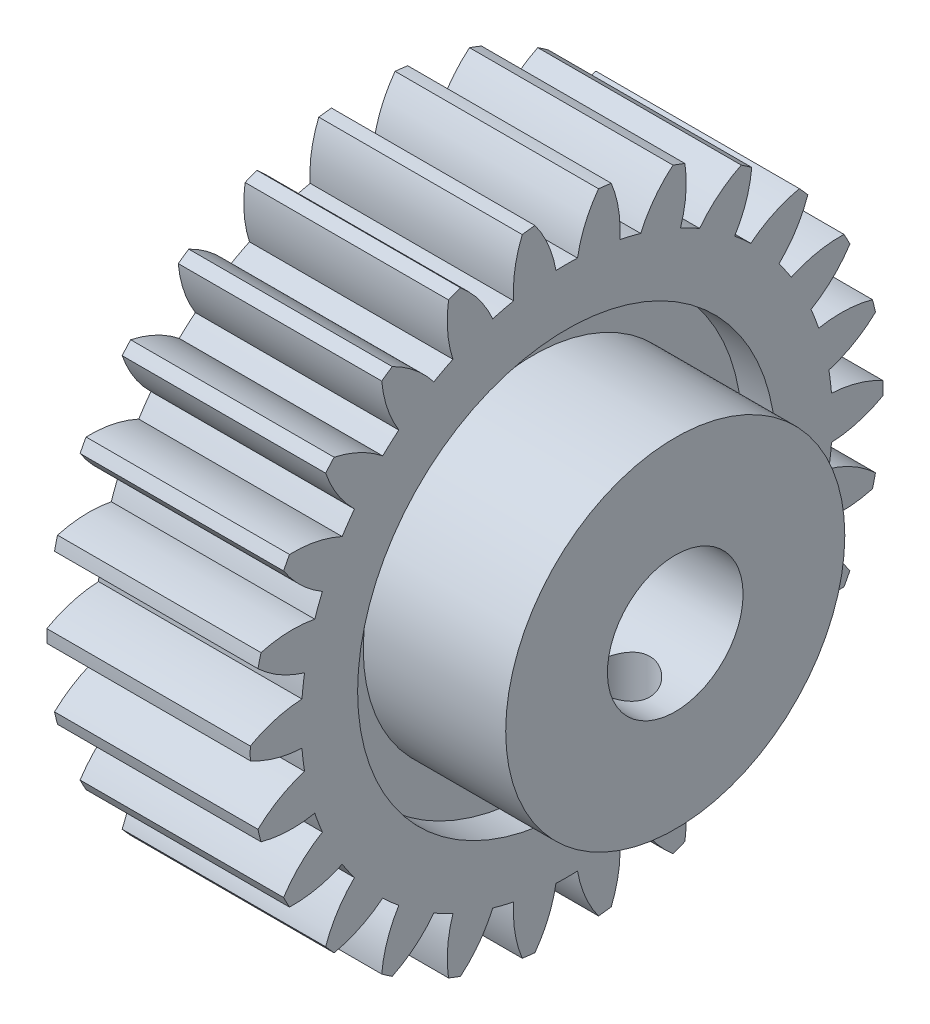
from build123d import *

# Parameters (mm, degrees)
BASPROSKE_W             = 9
BASPROSKE_H             = 14
TOOTHCUT_DEPTH          = 22.748563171
TEETHCUTS_COUNT         = 26
TEETHCUTS_ANGLE         = 346.153846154
HUBNEAONESKE_R          = 7.5
HUBNEARONE_DEPTH        = 9.0000508
BORSKE_R                = 3
BORE_DEPTH              = 18.0000508
CUT_EXTRUDE1_DEPTH      = 22.703049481
CUT_EXTRUDE1_DEPTH_BACK = 22.703049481
SKETCH1_W               = 6.3000508
SKETCH1_H               = 15.02384493
SKETCH2_R               = 9.25
SKETCH2_R_2             = 7.5
CUT_EXTRUDE2_DEPTH      = 1.5
CUT_EXTRUDE3_START      = -7.5
SKETCH2_2_R             = 9.25
SKETCH2_2_R_2           = 7.5
CUT_EXTRUDE3_DEPTH      = 1.5
BOSS_EXTRUDE1_START     = 4.8
SKETCH3_R               = 7.5
SKETCH3_R_2             = 3
BOSS_EXTRUDE1_DEPTH     = 4.8
CUT_EXTRUDE4_REACH      = 26.093
CUT_EXTRUDE4_END_RADIUS = 7.5
SKETCH5_R               = 1.275


with BuildPart() as part:
    # BasProSke → Base-Revolve (revolve)
    with BuildSketch(Plane(origin=(0, 0, 0), x_dir=(1, 0, 0), z_dir=(0, 1, 0)), mode=Mode.PRIVATE) as base_revolve_sk:
        with Locations((4.5, 7)):
            Rectangle(BASPROSKE_W, BASPROSKE_H)
    revolve(base_revolve_sk.sketch.rotate(Axis((-10, 0, 0), (1, 0, 0)), 180), axis=Axis((-10, 0, 0), (1, 0, 0)))

    # TooCutSke → ToothCut (cut, through all)
    with BuildSketch(Plane(origin=(0, 0, 0), x_dir=(0, 0, -1), z_dir=(1, 0, 0))):
        with BuildLine():
            ThreePointArc((0.476965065, 11.739314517), (0, 11.749), (-0.476965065, 11.739314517))
            ThreePointArc((-0.476965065, 11.739314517), (-0.82065865, 12.901686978), (-1.424117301, 13.952911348))
            ThreePointArc((-1.424117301, 13.952911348), (0, 14.0254), (1.424117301, 13.952911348))
            ThreePointArc((1.424117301, 13.952911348), (0.82065865, 12.901686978), (0.476965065, 11.739314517))
        make_face()
    toothcut = extrude(amount=TOOTHCUT_DEPTH, mode=Mode.SUBTRACT)

    # TeethCuts: ToothCut ×26 about axis
    teethcuts_axis = Axis((-10, 0, 0), (1, 0, 0))
    for i in range(1, TEETHCUTS_COUNT):
        add(toothcut.rotate(teethcuts_axis, i * TEETHCUTS_ANGLE / (TEETHCUTS_COUNT - 1)), mode=Mode.SUBTRACT)

    # HubNeaOneSke → HubNearOne (add)
    with BuildSketch(Plane.ZY):
        with Locations(Location((0, 0, 0), (0, 0, 180))):
            Circle(HUBNEAONESKE_R)
    extrude(amount=HUBNEARONE_DEPTH)

    # BorSke → Bore (cut, symmetric)
    with BuildSketch(Plane(origin=(0, 0, 0), x_dir=(0, 0, -1), z_dir=(1, 0, 0))):
        with Locations(Location((0, 0, 0), (0, 0, 180))):
            Circle(BORSKE_R)
    extrude(amount=BORE_DEPTH, both=True, mode=Mode.SUBTRACT)

    # Sketch1 → Cut-Extrude1 (cut, two sides: drawn at the far end of the back side and taken through both)
    with BuildSketch(Plane.XY.offset(-CUT_EXTRUDE1_DEPTH_BACK)):
        with Locations((-5.8500254, -0.011922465)):
            Rectangle(SKETCH1_W, SKETCH1_H)
    extrude(amount=CUT_EXTRUDE1_DEPTH + CUT_EXTRUDE1_DEPTH_BACK, mode=Mode.SUBTRACT)

    # Sketch2 → Cut-Extrude2 (cut)
    with BuildSketch(Plane(origin=(9, 0, 0), x_dir=(0, 0, -1), z_dir=(1, 0, 0))):
        Circle(SKETCH2_R)
        Circle(SKETCH2_R_2, mode=Mode.SUBTRACT)
    extrude(amount=-CUT_EXTRUDE2_DEPTH, mode=Mode.SUBTRACT)

    # Sketch2_2 → Cut-Extrude3 (cut)
    with BuildSketch(Plane(origin=(9, 0, 0), x_dir=(0, 0, -1), z_dir=(1, 0, 0)).offset(CUT_EXTRUDE3_START)):
        Circle(SKETCH2_2_R)
        Circle(SKETCH2_2_R_2, mode=Mode.SUBTRACT)
    extrude(amount=-CUT_EXTRUDE3_DEPTH, mode=Mode.SUBTRACT)

    # Sketch3 → Boss-Extrude1 (add)
    with BuildSketch(Plane(origin=(9, 0, 0), x_dir=(0, 0, -1), z_dir=(1, 0, 0)).offset(BOSS_EXTRUDE1_START)):
        Circle(SKETCH3_R)
        with Locations(Location((0, 0, 0), (0, 0, 90))):
            Circle(SKETCH3_R_2, mode=Mode.SUBTRACT)
    extrude(amount=-BOSS_EXTRUDE1_DEPTH)

    # Cut-Extrude4: up to this cylinder (the profile starts inside it)
    cut_extrude4_end = Plane(origin=(11.4, 0, 0), z_dir=(1, 0, 0)) * Cylinder(CUT_EXTRUDE4_END_RADIUS, 68.186, mode=Mode.PRIVATE)
    # Sketch5 → Cut-Extrude4 (cut, up to the surface)
    with BuildSketch(Plane(origin=(0, 0, 0), x_dir=(1, 0, 0), z_dir=(0, 1, 0)), mode=Mode.PRIVATE) as cut_extrude4_sk1:
        with Locations(Location((11.4, 0, 0), (0, 0, 270))):
            Circle(SKETCH5_R)
    cut_extrude4_tool1 = extrude(cut_extrude4_sk1.sketch, amount=-CUT_EXTRUDE4_REACH, mode=Mode.PRIVATE) & cut_extrude4_end
    add(cut_extrude4_tool1.solids().sort_by_distance((11.4, 0, 0))[0], mode=Mode.SUBTRACT)


solid = part.part
